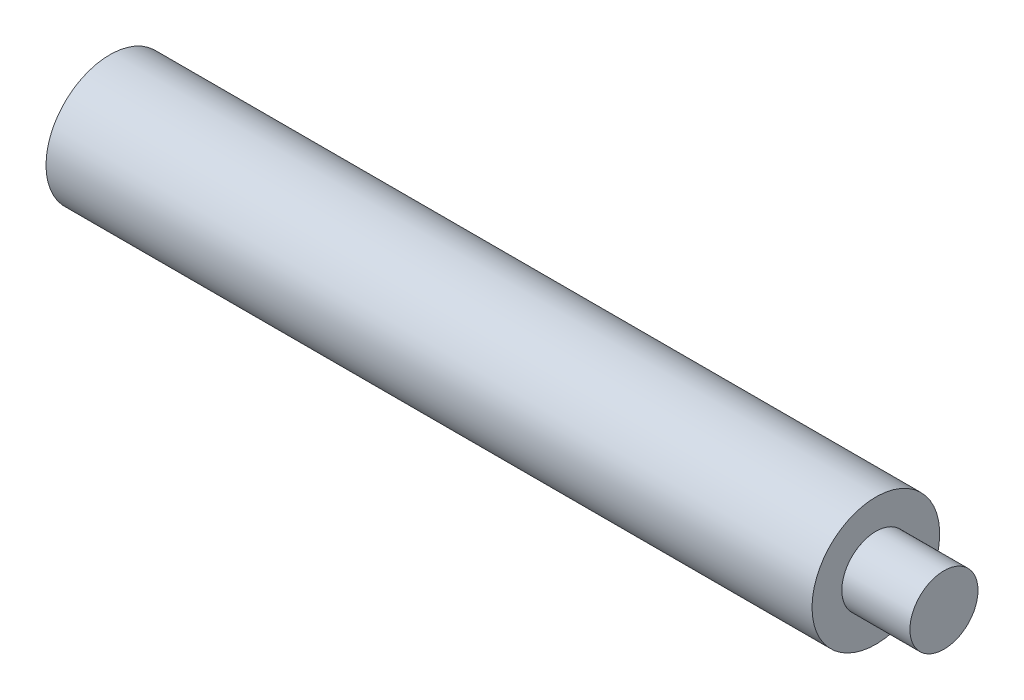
from build123d import *

# Parameters (mm, degrees)
ESQUISSE1_R        = 7.5
ESQUISSE1_R_2      = 4
EXTRUSION1_DEPTH   = 90
ESQUISSE2_R        = 4
BOSS_EXTRU_1_DEPTH = 8


with BuildPart() as part:
    # Esquisse1 → Extrusion1 (new body)
    with BuildSketch(Plane(origin=(0, 0, 0), x_dir=(0, 0, -1), z_dir=(1, 0, 0))):
        with Locations(Location((0, 0, 0), (0, 0, 180))):
            Circle(ESQUISSE1_R)
        with Locations(Location((0, 0, 0), (0, 0, 180))):
            Circle(ESQUISSE1_R_2, mode=Mode.SUBTRACT)
    extrude(amount=EXTRUSION1_DEPTH)


with BuildPart() as body_2:
    # Esquisse2 → Boss.-Extru.1 (new body)
    with BuildSketch(Plane(origin=(90, 0, 0), x_dir=(0, 0, -1), z_dir=(1, 0, 0))):
        Circle(ESQUISSE2_R)
    extrude(amount=BOSS_EXTRU_1_DEPTH)


solid = Compound([part.part, body_2.part])
